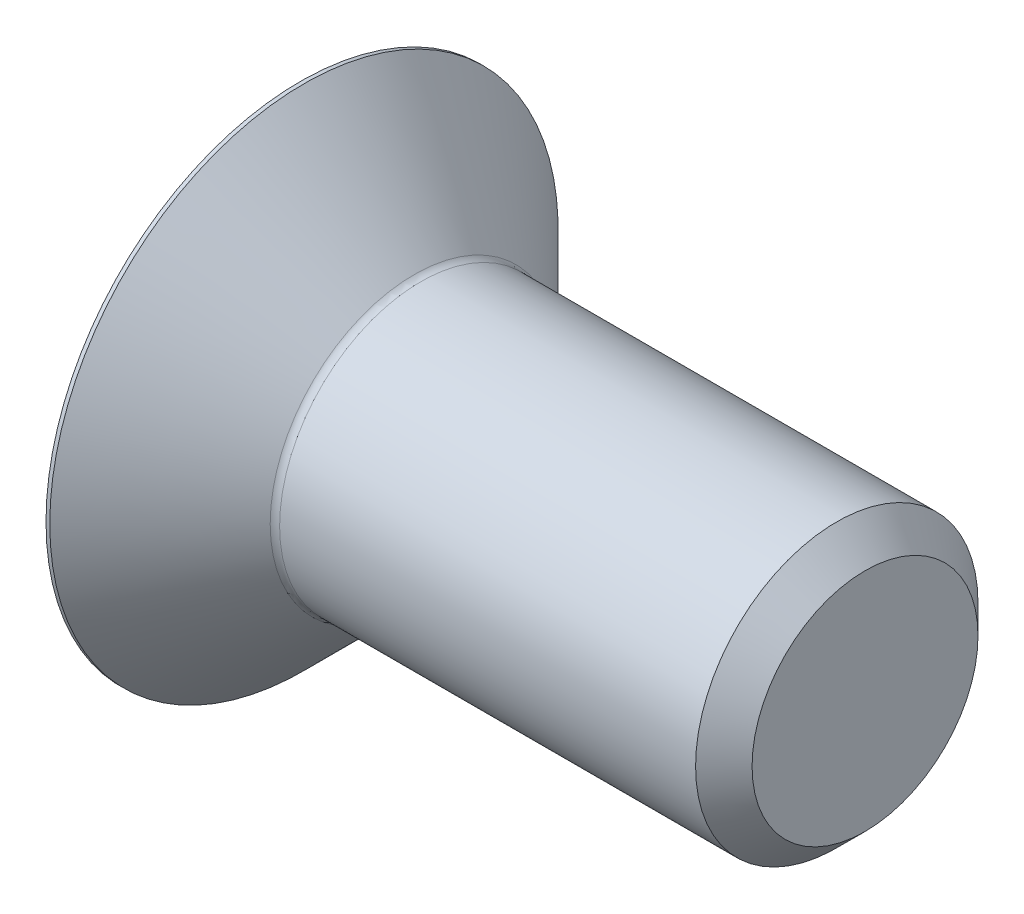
from build123d import *

# Parameters (mm, degrees)
FILLET1_R   = 0.2
HEX_2_DEPTH = 1.5


with BuildPart() as part:
    # BodySke → BaseBody (revolve)
    with BuildSketch(Plane.XY, mode=Mode.PRIVATE) as basebody_sk:
        Polygon((0, 0), (0, 5.4), (0.08, 5.4), (2.48, 3), (11.4, 3), (12, 2.4), (12, 0), align=None)
    revolve(basebody_sk.sketch.rotate(Axis((0, 0, 0), (1, 0, 0)), 90), axis=Axis((0, 0, 0), (1, 0, 0)))

    # Fillet1
    fillet1_edges = [part.edges().sort_by_distance(p)[0] for p in [
        (2.48, 0, -3),
    ]]
    fillet(fillet1_edges, radius=FILLET1_R)

    # Sketch2 → PreBroach (revolve, cut)
    with BuildSketch(Plane.XY, mode=Mode.PRIVATE) as prebroach_sk:
        Polygon((0, 1.25), (1.5, 1.25), (2.221687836, 0), (0, 0), align=None)
    revolve(prebroach_sk.sketch.rotate(Axis((0, 0, 0), (1, 0, 0)), 90), axis=Axis((0, 0, 0), (1, 0, 0)), mode=Mode.SUBTRACT)

    # Sketch3 → Hex 2 (cut)
    with BuildSketch(Plane.ZY):
        Polygon((-2, -1.154700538), (-2, 1.154700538), (0, 2.309401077), (2, 1.154700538), (2, -1.154700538), (0, -2.309401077), align=None)
    extrude(amount=-HEX_2_DEPTH, mode=Mode.SUBTRACT)


solid = part.part
